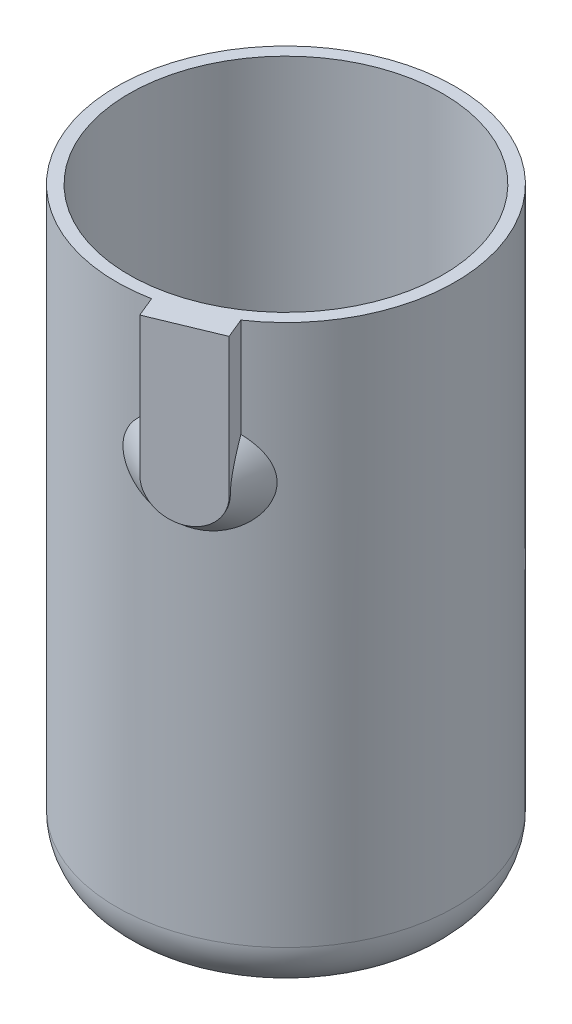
ISO-10303-21;
HEADER;
FILE_DESCRIPTION(('STEP AP214'),'2;1');
FILE_NAME('part.step','',(''),(''),'','','');
FILE_SCHEMA(('AUTOMOTIVE_DESIGN { 1 0 10303 214 1 1 1 1 }'));
ENDSEC;
DATA;
#1=APPLICATION_CONTEXT('core data for automotive mechanical design processes');
#2=APPLICATION_PROTOCOL_DEFINITION('international standard','automotive_design',2000,#1);
#3=PRODUCT_CONTEXT('',#1,'mechanical');
#4=PRODUCT('Part','Part','',(#3));
#5=PRODUCT_RELATED_PRODUCT_CATEGORY('part','',(#4));
#6=PRODUCT_DEFINITION_FORMATION('','',#4);
#7=PRODUCT_DEFINITION_CONTEXT('part definition',#1,'design');
#8=PRODUCT_DEFINITION('design','',#6,#7);
#9=PRODUCT_DEFINITION_SHAPE('','',#8);
#10=(LENGTH_UNIT() NAMED_UNIT(*) SI_UNIT(.MILLI.,.METRE.));
#11=(NAMED_UNIT(*) PLANE_ANGLE_UNIT() SI_UNIT($,.RADIAN.));
#12=(NAMED_UNIT(*) SI_UNIT($,.STERADIAN.) SOLID_ANGLE_UNIT());
#13=UNCERTAINTY_MEASURE_WITH_UNIT(LENGTH_MEASURE(1.E-05),#10,'distance_accuracy_value','');
#14=(GEOMETRIC_REPRESENTATION_CONTEXT(3) GLOBAL_UNCERTAINTY_ASSIGNED_CONTEXT((#13)) GLOBAL_UNIT_ASSIGNED_CONTEXT((#10,
#11,#12)) REPRESENTATION_CONTEXT('',''));
#15=CARTESIAN_POINT('',(0.,0.,0.));
#16=DIRECTION('',(0.,0.,1.));
#17=DIRECTION('',(1.,0.,0.));
#18=AXIS2_PLACEMENT_3D('',#15,#16,#17);
#19=CARTESIAN_POINT('',(0.,0.,0.));
#20=DIRECTION('',(0.,-1.,0.));
#21=DIRECTION('',(0.,0.,-1.));
#22=AXIS2_PLACEMENT_3D('',#19,#20,#21);
#23=CYLINDRICAL_SURFACE('',#22,27.25);
#24=CARTESIAN_POINT('',(0.,-87.1,0.));
#25=DIRECTION('',(0.,-1.,0.));
#26=DIRECTION('',(0.,0.,-1.));
#27=AXIS2_PLACEMENT_3D('',#24,#25,#26);
#28=CIRCLE('',#27,27.25);
#29=CARTESIAN_POINT('',(0.,-87.1,-27.25));
#30=VERTEX_POINT('',#29);
#31=EDGE_CURVE('E207',#30,#30,#28,.T.);
#32=ORIENTED_EDGE('',*,*,#31,.F.);
#33=EDGE_LOOP('',(#32));
#34=FACE_BOUND('',#33,.T.);
#35=CARTESIAN_POINT('',(0.,0.,0.));
#36=DIRECTION('',(0.,-1.,0.));
#37=DIRECTION('',(0.,0.,-1.));
#38=AXIS2_PLACEMENT_3D('',#35,#36,#37);
#39=CIRCLE('',#38,27.25);
#40=CARTESIAN_POINT('',(5.13217080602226,0.,26.7623489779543));
#41=VERTEX_POINT('',#40);
#42=CARTESIAN_POINT('',(15.2948456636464,0.,22.5528312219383));
#43=VERTEX_POINT('',#42);
#44=EDGE_CURVE('E57',#41,#43,#39,.T.);
#45=ORIENTED_EDGE('',*,*,#44,.T.);
#46=DIRECTION('',(0.,-1.,0.));
#47=VECTOR('',#46,1.);
#48=CARTESIAN_POINT('',(15.2948456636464,0.,22.5528312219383));
#49=LINE('',#48,#47);
#50=CARTESIAN_POINT('',(15.2948456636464,-15.9293145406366,22.5528312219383));
#51=VERTEX_POINT('',#50);
#52=EDGE_CURVE('E145',#43,#51,#49,.T.);
#53=ORIENTED_EDGE('',*,*,#52,.T.);
#54=CARTESIAN_POINT('',(3.39021248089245,-27.3423893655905,27.0382869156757));
#55=CARTESIAN_POINT('',(3.58895261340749,-27.53196795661,27.0133671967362));
#56=CARTESIAN_POINT('',(3.79571275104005,-27.712737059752,26.9852110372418));
#57=CARTESIAN_POINT('',(4.22272311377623,-28.0563612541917,26.9216965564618));
#58=CARTESIAN_POINT('',(4.44298101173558,-28.2192060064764,26.8863341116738));
#59=CARTESIAN_POINT('',(4.89513629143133,-28.52687842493,26.807702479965));
#60=CARTESIAN_POINT('',(5.12705897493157,-28.6716643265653,26.7644155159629));
#61=CARTESIAN_POINT('',(5.60001691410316,-28.9423832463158,26.6694673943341));
#62=CARTESIAN_POINT('',(5.8410525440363,-29.0683154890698,26.6178058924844));
#63=CARTESIAN_POINT('',(6.33176683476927,-29.3015675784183,26.5053761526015));
#64=CARTESIAN_POINT('',(6.58148878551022,-29.4087708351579,26.4445549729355));
#65=CARTESIAN_POINT('',(7.08628998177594,-29.6031445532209,26.3137791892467));
#66=CARTESIAN_POINT('',(7.34136937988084,-29.6903144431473,26.2438243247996));
#67=CARTESIAN_POINT('',(7.85477618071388,-29.8440752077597,26.094757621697));
#68=CARTESIAN_POINT('',(8.11310058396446,-29.91068381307,26.0156537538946));
#69=CARTESIAN_POINT('',(8.63134056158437,-30.0230071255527,25.8483384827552));
#70=CARTESIAN_POINT('',(8.89125614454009,-30.0687217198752,25.7601270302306));
#71=CARTESIAN_POINT('',(9.41921029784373,-30.1400743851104,25.5718990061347));
#72=CARTESIAN_POINT('',(9.68724021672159,-30.1650166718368,25.4715932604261));
#73=CARTESIAN_POINT('',(10.2209959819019,-30.1921021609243,25.2621443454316));
#74=CARTESIAN_POINT('',(10.4867217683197,-30.1942447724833,25.1530009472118));
#75=CARTESIAN_POINT('',(11.0139427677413,-30.1757119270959,24.9266498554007));
#76=CARTESIAN_POINT('',(11.2754375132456,-30.1550339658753,24.8094412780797));
#77=CARTESIAN_POINT('',(11.7923185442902,-30.0910190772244,24.5679688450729));
#78=CARTESIAN_POINT('',(12.0477049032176,-30.0476824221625,24.4437050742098));
#79=CARTESIAN_POINT('',(12.5474217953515,-29.9393774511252,24.1909508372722));
#80=CARTESIAN_POINT('',(12.7918523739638,-29.8746950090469,24.0625354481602));
#81=CARTESIAN_POINT('',(13.2716072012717,-29.7239955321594,23.8012930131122));
#82=CARTESIAN_POINT('',(13.5069314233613,-29.6379784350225,23.6684659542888));
#83=CARTESIAN_POINT('',(13.9672875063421,-29.4450355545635,23.3997536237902));
#84=CARTESIAN_POINT('',(14.1923116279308,-29.3380943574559,23.2638661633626));
#85=CARTESIAN_POINT('',(14.6306370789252,-29.103863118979,22.9907295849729));
#86=CARTESIAN_POINT('',(14.8439384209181,-28.9765730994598,22.8534804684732));
#87=CARTESIAN_POINT('',(15.261009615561,-28.6999029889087,22.5771492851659));
#88=CARTESIAN_POINT('',(15.4645681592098,-28.550197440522,22.4380736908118));
#89=CARTESIAN_POINT('',(15.8571145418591,-28.230752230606,22.1623993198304));
#90=CARTESIAN_POINT('',(16.0461032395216,-28.0610137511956,22.025800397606));
#91=CARTESIAN_POINT('',(16.4080576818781,-27.7020268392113,21.7575005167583));
#92=CARTESIAN_POINT('',(16.5810364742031,-27.5127945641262,21.6257956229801));
#93=CARTESIAN_POINT('',(16.9095211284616,-27.1152156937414,21.3699315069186));
#94=CARTESIAN_POINT('',(17.0650339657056,-26.9068767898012,21.2457692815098));
#95=CARTESIAN_POINT('',(17.4182638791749,-26.3798438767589,20.9580018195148));
#96=CARTESIAN_POINT('',(17.6062811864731,-26.0515466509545,20.799727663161));
#97=CARTESIAN_POINT('',(17.9366989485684,-25.3601194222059,20.5154821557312));
#98=CARTESIAN_POINT('',(18.0791772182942,-24.9970502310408,20.3894557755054));
#99=CARTESIAN_POINT('',(18.292024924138,-24.3034344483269,20.1985503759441));
#100=CARTESIAN_POINT('',(18.3703468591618,-23.9771807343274,20.1270650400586));
#101=CARTESIAN_POINT('',(18.4851144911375,-23.3114724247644,20.0217203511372));
#102=CARTESIAN_POINT('',(18.5215915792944,-22.9720279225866,19.9878327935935));
#103=CARTESIAN_POINT('',(18.5501837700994,-22.2887178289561,19.9613032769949));
#104=CARTESIAN_POINT('',(18.5421825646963,-21.9448429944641,19.9687694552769));
#105=CARTESIAN_POINT('',(18.482148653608,-21.2643164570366,20.0243411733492));
#106=CARTESIAN_POINT('',(18.4300999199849,-20.9276674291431,20.0724615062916));
#107=CARTESIAN_POINT('',(18.2877559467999,-20.2811026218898,20.2022089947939));
#108=CARTESIAN_POINT('',(18.1987189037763,-19.9706785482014,20.2827313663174));
#109=CARTESIAN_POINT('',(17.9869501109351,-19.370256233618,20.4707636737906));
#110=CARTESIAN_POINT('',(17.8641959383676,-19.0802717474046,20.5782915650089));
#111=CARTESIAN_POINT('',(17.526813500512,-18.3974832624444,20.8672500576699));
#112=CARTESIAN_POINT('',(17.2957550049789,-18.0175968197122,21.060094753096));
#113=CARTESIAN_POINT('',(16.7816419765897,-17.3108982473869,21.4720227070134));
#114=CARTESIAN_POINT('',(16.4985033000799,-16.9841736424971,21.6911482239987));
#115=CARTESIAN_POINT('',(15.8832490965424,-16.3814404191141,22.145732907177));
#116=CARTESIAN_POINT('',(15.5504528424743,-16.1062807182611,22.3813901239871));
#117=CARTESIAN_POINT('',(14.8453985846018,-15.6150877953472,22.8551240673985));
#118=CARTESIAN_POINT('',(14.4731513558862,-15.3990384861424,23.0932001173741));
#119=CARTESIAN_POINT('',(13.8595644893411,-15.1067611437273,23.4636819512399));
#120=CARTESIAN_POINT('',(13.6291340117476,-15.009971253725,23.598355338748));
#121=CARTESIAN_POINT('',(13.1583744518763,-14.8375024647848,23.8640444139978));
#122=CARTESIAN_POINT('',(12.9180444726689,-14.7618254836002,23.9950597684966));
#123=CARTESIAN_POINT('',(12.4289190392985,-14.6320780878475,24.2520276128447));
#124=CARTESIAN_POINT('',(12.1801213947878,-14.5780133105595,24.3779787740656));
#125=CARTESIAN_POINT('',(11.6756895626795,-14.4918897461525,24.6235547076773));
#126=CARTESIAN_POINT('',(11.4200555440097,-14.4598304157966,24.7431796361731));
#127=CARTESIAN_POINT('',(10.901455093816,-14.4177803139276,24.9760336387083));
#128=CARTESIAN_POINT('',(10.6384446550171,-14.4079805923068,25.0891992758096));
#129=CARTESIAN_POINT('',(10.1090934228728,-14.411088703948,25.3071266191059));
#130=CARTESIAN_POINT('',(9.84275258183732,-14.4239968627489,25.4118882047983));
#131=CARTESIAN_POINT('',(9.30875605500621,-14.4724153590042,25.612318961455));
#132=CARTESIAN_POINT('',(9.0411005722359,-14.5079223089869,25.7079894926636));
#133=CARTESIAN_POINT('',(8.50645619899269,-14.6012654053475,25.8898132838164));
#134=CARTESIAN_POINT('',(8.23946730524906,-14.6591014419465,25.9759665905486));
#135=CARTESIAN_POINT('',(7.7105597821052,-14.7960844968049,26.1378189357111));
#136=CARTESIAN_POINT('',(7.44861717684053,-14.8750373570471,26.2136041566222));
#137=CARTESIAN_POINT('',(6.92937561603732,-15.0539977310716,26.3556199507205));
#138=CARTESIAN_POINT('',(6.67207669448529,-15.1540053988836,26.4218504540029));
#139=CARTESIAN_POINT('',(6.16387451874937,-15.3746673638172,26.5450104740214));
#140=CARTESIAN_POINT('',(5.91297786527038,-15.4953420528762,26.6019306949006));
#141=CARTESIAN_POINT('',(5.4199045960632,-15.7567595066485,26.7067531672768));
#142=CARTESIAN_POINT('',(5.17772793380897,-15.8975021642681,26.7546554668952));
#143=CARTESIAN_POINT('',(4.70044423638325,-16.2010225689,26.8426553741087));
#144=CARTESIAN_POINT('',(4.46551376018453,-16.3641185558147,26.8826149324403));
#145=CARTESIAN_POINT('',(4.00940706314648,-16.7101168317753,26.9544143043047));
#146=CARTESIAN_POINT('',(3.78822952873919,-16.8930172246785,26.9862548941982));
#147=CARTESIAN_POINT('',(3.36272548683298,-17.2780043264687,27.0425692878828));
#148=CARTESIAN_POINT('',(3.15837608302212,-17.4800641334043,27.0670532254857));
#149=CARTESIAN_POINT('',(2.76964169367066,-17.9030098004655,27.1095893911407));
#150=CARTESIAN_POINT('',(2.5852468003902,-18.1238862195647,27.127644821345));
#151=CARTESIAN_POINT('',(2.18012149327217,-18.6640131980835,27.1636511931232));
#152=CARTESIAN_POINT('',(1.96903151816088,-18.9907764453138,27.1793854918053));
#153=CARTESIAN_POINT('',(1.60164588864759,-19.6742305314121,27.2035186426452));
#154=CARTESIAN_POINT('',(1.44528696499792,-20.0308862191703,27.2119259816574));
#155=CARTESIAN_POINT('',(1.2603492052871,-20.5843484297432,27.2209076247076));
#156=CARTESIAN_POINT('',(1.20681656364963,-20.7729947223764,27.2232995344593));
#157=CARTESIAN_POINT('',(1.11814216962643,-21.1545338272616,27.2270867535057));
#158=CARTESIAN_POINT('',(1.08299080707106,-21.3474243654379,27.2284825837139));
#159=CARTESIAN_POINT('',(1.03209314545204,-21.7356595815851,27.2304599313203));
#160=CARTESIAN_POINT('',(1.01633588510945,-21.9310028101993,27.2310419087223));
#161=CARTESIAN_POINT('',(1.0046292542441,-22.3222166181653,27.2314745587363));
#162=CARTESIAN_POINT('',(1.00867729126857,-22.5180871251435,27.2313253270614));
#163=CARTESIAN_POINT('',(1.04649052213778,-23.0475326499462,27.2299145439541));
#164=CARTESIAN_POINT('',(1.09935321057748,-23.379910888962,27.2279370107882));
#165=CARTESIAN_POINT('',(1.25871813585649,-24.0313363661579,27.2210253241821));
#166=CARTESIAN_POINT('',(1.36525478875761,-24.3503749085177,27.2160892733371));
#167=CARTESIAN_POINT('',(1.62806975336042,-24.9773821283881,27.2016469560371));
#168=CARTESIAN_POINT('',(1.78565093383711,-25.2847949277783,27.192017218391));
#169=CARTESIAN_POINT('',(2.14083923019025,-25.8748248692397,27.1663554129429));
#170=CARTESIAN_POINT('',(2.33842736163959,-26.1574536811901,27.1503263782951));
#171=CARTESIAN_POINT('',(2.68098585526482,-26.5891390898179,27.1181052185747));
#172=CARTESIAN_POINT('',(2.81571589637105,-26.746689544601,27.1045026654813));
#173=CARTESIAN_POINT('',(3.09552046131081,-27.0519533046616,27.0739735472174));
#174=CARTESIAN_POINT('',(3.24059375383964,-27.1996677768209,27.0570473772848));
#175=CARTESIAN_POINT('',(3.39021248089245,-27.3423893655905,27.0382869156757));
#176=B_SPLINE_CURVE_WITH_KNOTS('',3,(#54,#55,#56,#57,#58,#59,#60,#61,#62,#63,#64,#65,#66,#67,
#68,#69,#70,#71,#72,#73,#74,#75,#76,#77,#78,#79,#80,#81,#82,#83,#84,#85,#86,#87,#88,#89,#90,#91,
#92,#93,#94,#95,#96,#97,#98,#99,#100,#101,#102,#103,#104,#105,#106,#107,#108,#109,#110,#111,
#112,#113,#114,#115,#116,#117,#118,#119,#120,#121,#122,#123,#124,#125,#126,#127,#128,#129,#130,
#131,#132,#133,#134,#135,#136,#137,#138,#139,#140,#141,#142,#143,#144,#145,#146,#147,#148,#149,
#150,#151,#152,#153,#154,#155,#156,#157,#158,#159,#160,#161,#162,#163,#164,#165,#166,#167,#168,
#169,#170,#171,#172,#173,#174,#175),.UNSPECIFIED.,.T.,.F.,(4,2,2,2,2,2,2,2,2,2,2,2,2,2,2,2,2,2,
2,2,2,2,2,2,2,2,2,2,2,2,2,2,2,2,2,2,2,2,2,2,2,2,2,2,2,2,2,2,2,2,2,2,2,2,2,2,2,2,2,2,4),(0.,
0.827146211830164,1.65476706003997,2.48426778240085,3.31380260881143,4.14833038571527,
4.98288196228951,5.81671185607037,6.65054625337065,7.51129970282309,8.37207545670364,
9.23294567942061,10.0938055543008,10.9435749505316,11.7933468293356,12.6437470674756,
13.494146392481,14.358369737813,15.2225421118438,16.0860038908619,16.9491195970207,
18.1746763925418,19.3981276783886,20.4229041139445,21.4469112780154,22.4735974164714,
23.5006573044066,24.4953206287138,25.4906470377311,26.9367776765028,28.3852656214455,
29.8558314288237,31.3259966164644,32.1768697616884,33.0278201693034,33.8789923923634,
34.7301436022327,35.5885729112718,36.4470145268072,37.3053274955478,38.1636362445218,
39.0143095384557,39.8649890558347,40.7165128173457,41.5680320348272,42.4332586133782,
43.298402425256,44.1623489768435,45.0258645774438,46.1894536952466,47.3516932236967,
47.9392502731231,48.5264998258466,49.1134173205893,49.7002579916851,50.7047089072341,
51.7098047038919,52.7428969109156,53.775500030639,54.398279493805,55.0209849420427),.UNSPECIFIED.);
#177=CARTESIAN_POINT('',(5.13217080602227,-15.9293145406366,26.7623489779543));
#178=VERTEX_POINT('',#177);
#179=EDGE_CURVE('E11',#178,#51,#176,.T.);
#180=ORIENTED_EDGE('',*,*,#179,.F.);
#181=DIRECTION('',(0.,-1.,0.));
#182=VECTOR('',#181,1.);
#183=CARTESIAN_POINT('',(5.13217080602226,0.,26.7623489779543));
#184=LINE('',#183,#182);
#185=EDGE_CURVE('E53',#178,#41,#184,.F.);
#186=ORIENTED_EDGE('',*,*,#185,.T.);
#187=EDGE_LOOP('',(#45,#53,#180,#186));
#188=FACE_BOUND('',#187,.T.);
#189=ADVANCED_FACE('F37',(#34,#188),#23,.T.);
#190=CARTESIAN_POINT('',(0.,0.,0.));
#191=DIRECTION('',(0.,-1.,0.));
#192=DIRECTION('',(0.,0.,-1.));
#193=AXIS2_PLACEMENT_3D('',#190,#191,#192);
#194=CYLINDRICAL_SURFACE('',#193,25.25);
#195=CARTESIAN_POINT('',(0.,0.,0.));
#196=DIRECTION('',(0.,-1.,0.));
#197=DIRECTION('',(0.,0.,-1.));
#198=AXIS2_PLACEMENT_3D('',#195,#196,#197);
#199=CIRCLE('',#198,25.25);
#200=CARTESIAN_POINT('',(0.,0.,-25.25));
#201=VERTEX_POINT('',#200);
#202=EDGE_CURVE('E211',#201,#201,#199,.T.);
#203=ORIENTED_EDGE('',*,*,#202,.F.);
#204=EDGE_LOOP('',(#203));
#205=FACE_BOUND('',#204,.T.);
#206=CARTESIAN_POINT('',(0.,-85.1,0.));
#207=DIRECTION('',(0.,-1.,0.));
#208=DIRECTION('',(0.,0.,-1.));
#209=AXIS2_PLACEMENT_3D('',#206,#207,#208);
#210=CIRCLE('',#209,25.25);
#211=CARTESIAN_POINT('',(0.,-85.1,-25.25));
#212=VERTEX_POINT('',#211);
#213=EDGE_CURVE('E214',#212,#212,#210,.T.);
#214=ORIENTED_EDGE('',*,*,#213,.T.);
#215=EDGE_LOOP('',(#214));
#216=FACE_BOUND('',#215,.T.);
#217=ADVANCED_FACE('F159',(#205,#216),#194,.F.);
#218=CARTESIAN_POINT('',(0.,-93.3,0.));
#219=DIRECTION('',(0.,1.,0.));
#220=DIRECTION('',(0.,0.,1.));
#221=AXIS2_PLACEMENT_3D('',#218,#219,#220);
#222=PLANE('',#221);
#223=CARTESIAN_POINT('',(0.,-93.3,0.));
#224=DIRECTION('',(0.,-1.,0.));
#225=DIRECTION('',(0.,0.,-1.));
#226=AXIS2_PLACEMENT_3D('',#223,#224,#225);
#227=CIRCLE('',#226,9.);
#228=CARTESIAN_POINT('',(0.,-93.3,-9.));
#229=VERTEX_POINT('',#228);
#230=EDGE_CURVE('E41',#229,#229,#227,.T.);
#231=ORIENTED_EDGE('',*,*,#230,.T.);
#232=EDGE_LOOP('',(#231));
#233=FACE_BOUND('',#232,.T.);
#234=ADVANCED_FACE('F39',(#233),#222,.F.);
#235=CARTESIAN_POINT('',(0.,-92.3,0.));
#236=DIRECTION('',(0.,-1.,0.));
#237=DIRECTION('',(0.,0.,-1.));
#238=AXIS2_PLACEMENT_3D('',#235,#236,#237);
#239=TOROIDAL_SURFACE('',#238,9.00000000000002,0.999999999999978);
#240=ORIENTED_EDGE('',*,*,#230,.F.);
#241=EDGE_LOOP('',(#240));
#242=FACE_BOUND('',#241,.T.);
#243=CARTESIAN_POINT('',(0.,-92.3,0.));
#244=DIRECTION('',(0.,-1.,0.));
#245=DIRECTION('',(0.,0.,-1.));
#246=AXIS2_PLACEMENT_3D('',#243,#244,#245);
#247=CIRCLE('',#246,9.99999999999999);
#248=CARTESIAN_POINT('',(0.,-92.3,-9.99999999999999));
#249=VERTEX_POINT('',#248);
#250=EDGE_CURVE('E193',#249,#249,#247,.T.);
#251=ORIENTED_EDGE('',*,*,#250,.T.);
#252=EDGE_LOOP('',(#251));
#253=FACE_BOUND('',#252,.T.);
#254=ADVANCED_FACE('F180',(#242,#253),#239,.T.);
#255=CARTESIAN_POINT('',(0.,0.,0.));
#256=DIRECTION('',(0.,-1.,0.));
#257=DIRECTION('',(0.,0.,-1.));
#258=AXIS2_PLACEMENT_3D('',#255,#256,#257);
#259=CYLINDRICAL_SURFACE('',#258,10.);
#260=ORIENTED_EDGE('',*,*,#250,.F.);
#261=EDGE_LOOP('',(#260));
#262=FACE_BOUND('',#261,.T.);
#263=CARTESIAN_POINT('',(0.,-90.3,0.));
#264=DIRECTION('',(0.,-1.,0.));
#265=DIRECTION('',(0.,0.,-1.));
#266=AXIS2_PLACEMENT_3D('',#263,#264,#265);
#267=CIRCLE('',#266,10.);
#268=CARTESIAN_POINT('',(0.,-90.3,-10.));
#269=VERTEX_POINT('',#268);
#270=EDGE_CURVE('E194',#269,#269,#267,.T.);
#271=ORIENTED_EDGE('',*,*,#270,.T.);
#272=EDGE_LOOP('',(#271));
#273=FACE_BOUND('',#272,.T.);
#274=ADVANCED_FACE('F177',(#262,#273),#259,.T.);
#275=CARTESIAN_POINT('',(0.,-80.2999999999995,0.));
#276=DIRECTION('',(0.,-1.,0.));
#277=DIRECTION('',(0.,0.,-1.));
#278=AXIS2_PLACEMENT_3D('',#275,#276,#277);
#279=DEGENERATE_TOROIDAL_SURFACE('',#278,9.99999999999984,10.0000000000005,.T.);
#280=ORIENTED_EDGE('',*,*,#270,.F.);
#281=EDGE_LOOP('',(#280));
#282=FACE_BOUND('',#281,.T.);
#283=CARTESIAN_POINT('',(0.,-88.9602540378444,0.));
#284=DIRECTION('',(0.,-1.,0.));
#285=DIRECTION('',(0.,0.,-1.));
#286=AXIS2_PLACEMENT_3D('',#283,#284,#285);
#287=CIRCLE('',#286,15.);
#288=CARTESIAN_POINT('',(0.,-88.9602540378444,-15.));
#289=VERTEX_POINT('',#288);
#290=EDGE_CURVE('E196',#289,#289,#287,.T.);
#291=ORIENTED_EDGE('',*,*,#290,.T.);
#292=EDGE_LOOP('',(#291));
#293=FACE_BOUND('',#292,.T.);
#294=ADVANCED_FACE('F173',(#282,#293),#279,.T.);
#295=CARTESIAN_POINT('',(0.,0.,0.));
#296=DIRECTION('',(0.,-1.,0.));
#297=DIRECTION('',(0.,0.,-1.));
#298=AXIS2_PLACEMENT_3D('',#295,#296,#297);
#299=CYLINDRICAL_SURFACE('',#298,15.);
#300=ORIENTED_EDGE('',*,*,#290,.F.);
#301=EDGE_LOOP('',(#300));
#302=FACE_BOUND('',#301,.T.);
#303=CARTESIAN_POINT('',(0.,-95.3,0.));
#304=DIRECTION('',(0.,-1.,0.));
#305=DIRECTION('',(0.,0.,-1.));
#306=AXIS2_PLACEMENT_3D('',#303,#304,#305);
#307=CIRCLE('',#306,15.);
#308=CARTESIAN_POINT('',(0.,-95.3,-15.));
#309=VERTEX_POINT('',#308);
#310=EDGE_CURVE('E201',#309,#309,#307,.T.);
#311=ORIENTED_EDGE('',*,*,#310,.T.);
#312=EDGE_LOOP('',(#311));
#313=FACE_BOUND('',#312,.T.);
#314=ADVANCED_FACE('F169',(#302,#313),#299,.F.);
#315=CARTESIAN_POINT('',(-15.,-95.3,0.));
#316=DIRECTION('',(0.,1.,0.));
#317=DIRECTION('',(0.,0.,1.));
#318=AXIS2_PLACEMENT_3D('',#315,#316,#317);
#319=PLANE('',#318);
#320=ORIENTED_EDGE('',*,*,#310,.F.);
#321=EDGE_LOOP('',(#320));
#322=FACE_BOUND('',#321,.T.);
#323=CARTESIAN_POINT('',(0.,-95.3,0.));
#324=DIRECTION('',(0.,-1.,0.));
#325=DIRECTION('',(0.,0.,-1.));
#326=AXIS2_PLACEMENT_3D('',#323,#324,#325);
#327=CIRCLE('',#326,19.05);
#328=CARTESIAN_POINT('',(0.,-95.3,-19.05));
#329=VERTEX_POINT('',#328);
#330=EDGE_CURVE('E204',#329,#329,#327,.T.);
#331=ORIENTED_EDGE('',*,*,#330,.T.);
#332=EDGE_LOOP('',(#331));
#333=FACE_BOUND('',#332,.T.);
#334=ADVANCED_FACE('F165',(#322,#333),#319,.F.);
#335=CARTESIAN_POINT('',(0.,-87.1,0.));
#336=DIRECTION('',(0.,-1.,0.));
#337=DIRECTION('',(0.,0.,-1.));
#338=AXIS2_PLACEMENT_3D('',#335,#336,#337);
#339=TOROIDAL_SURFACE('',#338,19.05,8.20000000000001);
#340=ORIENTED_EDGE('',*,*,#330,.F.);
#341=EDGE_LOOP('',(#340));
#342=FACE_BOUND('',#341,.T.);
#343=ORIENTED_EDGE('',*,*,#31,.T.);
#344=EDGE_LOOP('',(#343));
#345=FACE_BOUND('',#344,.T.);
#346=ADVANCED_FACE('F162',(#342,#345),#339,.T.);
#347=CARTESIAN_POINT('',(-27.25,0.,0.));
#348=DIRECTION('',(0.,-1.,0.));
#349=DIRECTION('',(0.,0.,-1.));
#350=AXIS2_PLACEMENT_3D('',#347,#348,#349);
#351=PLANE('',#350);
#352=ORIENTED_EDGE('',*,*,#44,.F.);
#353=DIRECTION('',(0.38268343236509,0.,0.923879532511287));
#354=VECTOR('',#353,1.);
#355=CARTESIAN_POINT('',(4.93348799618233,0.,26.2826862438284));
#356=LINE('',#355,#354);
#357=CARTESIAN_POINT('',(6.46422172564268,0.,29.9782043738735));
#358=VERTEX_POINT('',#357);
#359=EDGE_CURVE('E84',#41,#358,#356,.T.);
#360=ORIENTED_EDGE('',*,*,#359,.T.);
#361=DIRECTION('',(-0.923879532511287,0.,0.38268343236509));
#362=VECTOR('',#361,1.);
#363=CARTESIAN_POINT('',(16.6268965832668,0.,25.7686866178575));
#364=LINE('',#363,#362);
#365=CARTESIAN_POINT('',(16.6268965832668,0.,25.7686866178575));
#366=VERTEX_POINT('',#365);
#367=EDGE_CURVE('E90',#366,#358,#364,.T.);
#368=ORIENTED_EDGE('',*,*,#367,.F.);
#369=DIRECTION('',(0.38268343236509,0.,0.923879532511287));
#370=VECTOR('',#369,1.);
#371=CARTESIAN_POINT('',(15.0961628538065,0.,22.0731684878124));
#372=LINE('',#371,#370);
#373=EDGE_CURVE('E112',#43,#366,#372,.T.);
#374=ORIENTED_EDGE('',*,*,#373,.F.);
#375=EDGE_LOOP('',(#352,#360,#368,#374));
#376=FACE_BOUND('',#375,.T.);
#377=ORIENTED_EDGE('',*,*,#202,.T.);
#378=EDGE_LOOP('',(#377));
#379=FACE_BOUND('',#378,.T.);
#380=ADVANCED_FACE('F86',(#376,#379),#351,.F.);
#381=CARTESIAN_POINT('',(0.,-85.1,0.));
#382=DIRECTION('',(0.,-1.,0.));
#383=DIRECTION('',(0.,0.,-1.));
#384=AXIS2_PLACEMENT_3D('',#381,#382,#383);
#385=TOROIDAL_SURFACE('',#384,17.05,8.20000000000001);
#386=ORIENTED_EDGE('',*,*,#213,.F.);
#387=EDGE_LOOP('',(#386));
#388=FACE_BOUND('',#387,.T.);
#389=CARTESIAN_POINT('',(0.,-93.3,0.));
#390=DIRECTION('',(0.,-1.,0.));
#391=DIRECTION('',(0.,0.,-1.));
#392=AXIS2_PLACEMENT_3D('',#389,#390,#391);
#393=CIRCLE('',#392,17.05);
#394=CARTESIAN_POINT('',(0.,-93.3,-17.05));
#395=VERTEX_POINT('',#394);
#396=EDGE_CURVE('E217',#395,#395,#393,.T.);
#397=ORIENTED_EDGE('',*,*,#396,.T.);
#398=EDGE_LOOP('',(#397));
#399=FACE_BOUND('',#398,.T.);
#400=ADVANCED_FACE('F241',(#388,#399),#385,.F.);
#401=CARTESIAN_POINT('',(-17.05,-93.3,0.));
#402=DIRECTION('',(0.,-1.,0.));
#403=DIRECTION('',(0.,0.,-1.));
#404=AXIS2_PLACEMENT_3D('',#401,#402,#403);
#405=PLANE('',#404);
#406=ORIENTED_EDGE('',*,*,#396,.F.);
#407=EDGE_LOOP('',(#406));
#408=FACE_BOUND('',#407,.T.);
#409=CARTESIAN_POINT('',(0.,-93.3,0.));
#410=DIRECTION('',(0.,-1.,0.));
#411=DIRECTION('',(0.,0.,-1.));
#412=AXIS2_PLACEMENT_3D('',#409,#410,#411);
#413=CIRCLE('',#412,17.);
#414=CARTESIAN_POINT('',(0.,-93.3,-17.));
#415=VERTEX_POINT('',#414);
#416=EDGE_CURVE('E219',#415,#415,#413,.T.);
#417=ORIENTED_EDGE('',*,*,#416,.T.);
#418=EDGE_LOOP('',(#417));
#419=FACE_BOUND('',#418,.T.);
#420=ADVANCED_FACE('F235',(#408,#419),#405,.F.);
#421=CARTESIAN_POINT('',(0.,0.,0.));
#422=DIRECTION('',(0.,-1.,0.));
#423=DIRECTION('',(0.,0.,-1.));
#424=AXIS2_PLACEMENT_3D('',#421,#422,#423);
#425=CYLINDRICAL_SURFACE('',#424,17.);
#426=ORIENTED_EDGE('',*,*,#416,.F.);
#427=EDGE_LOOP('',(#426));
#428=FACE_BOUND('',#427,.T.);
#429=CARTESIAN_POINT('',(0.,-86.9602540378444,0.));
#430=DIRECTION('',(0.,-1.,0.));
#431=DIRECTION('',(0.,0.,-1.));
#432=AXIS2_PLACEMENT_3D('',#429,#430,#431);
#433=CIRCLE('',#432,17.);
#434=CARTESIAN_POINT('',(0.,-86.9602540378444,-17.));
#435=VERTEX_POINT('',#434);
#436=EDGE_CURVE('E149',#435,#435,#433,.T.);
#437=ORIENTED_EDGE('',*,*,#436,.T.);
#438=EDGE_LOOP('',(#437));
#439=FACE_BOUND('',#438,.T.);
#440=ADVANCED_FACE('F226',(#428,#439),#425,.T.);
#441=CARTESIAN_POINT('',(-17.,-86.9602540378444,0.));
#442=DIRECTION('',(0.,-1.,0.));
#443=DIRECTION('',(0.,0.,-1.));
#444=AXIS2_PLACEMENT_3D('',#441,#442,#443);
#445=PLANE('',#444);
#446=ORIENTED_EDGE('',*,*,#436,.F.);
#447=EDGE_LOOP('',(#446));
#448=FACE_BOUND('',#447,.T.);
#449=ADVANCED_FACE('F228',(#448),#445,.F.);
#450=CARTESIAN_POINT('',(9.56708580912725,-22.3,23.0969883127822));
#451=DIRECTION('',(-0.38268343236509,0.,-0.923879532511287));
#452=DIRECTION('',(-0.923879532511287,0.,0.38268343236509));
#453=AXIS2_PLACEMENT_3D('',#450,#451,#452);
#454=CONICAL_SURFACE('',#453,10.,0.753151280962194);
#455=ORIENTED_EDGE('',*,*,#179,.T.);
#456=CARTESIAN_POINT('',(15.096080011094,-15.2986252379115,22.0729684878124));
#457=CARTESIAN_POINT('',(15.1455588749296,-15.4527940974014,22.1924210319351));
#458=CARTESIAN_POINT('',(15.1946832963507,-15.6077496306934,22.3110178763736));
#459=CARTESIAN_POINT('',(15.292070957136,-15.9195396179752,22.5461324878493));
#460=CARTESIAN_POINT('',(15.3403340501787,-16.0763743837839,22.6626499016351));
#461=CARTESIAN_POINT('',(15.4360798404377,-16.393002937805,22.8938006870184));
#462=CARTESIAN_POINT('',(15.4835571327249,-16.5528079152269,23.008421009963));
#463=CARTESIAN_POINT('',(15.5772498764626,-16.8749164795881,23.2346153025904));
#464=CARTESIAN_POINT('',(15.6234653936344,-17.0372199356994,23.3461894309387));
#465=CARTESIAN_POINT('',(15.7166412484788,-17.3729633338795,23.5711358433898));
#466=CARTESIAN_POINT('',(15.7635226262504,-17.5465534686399,23.6843175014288));
#467=CARTESIAN_POINT('',(15.8551790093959,-17.8975379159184,23.9055955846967));
#468=CARTESIAN_POINT('',(15.8999537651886,-18.0749326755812,24.0136914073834));
#469=CARTESIAN_POINT('',(15.9867454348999,-18.4337771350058,24.2232250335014));
#470=CARTESIAN_POINT('',(16.0287679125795,-18.6152175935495,24.3246762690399));
#471=CARTESIAN_POINT('',(16.1094145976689,-18.9831539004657,24.5193745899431));
#472=CARTESIAN_POINT('',(16.1480398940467,-19.1696481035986,24.6126243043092));
#473=CARTESIAN_POINT('',(16.2165749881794,-19.5257147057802,24.7780826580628));
#474=CARTESIAN_POINT('',(16.2469745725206,-19.694638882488,24.8514737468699));
#475=CARTESIAN_POINT('',(16.3035838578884,-20.0373261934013,24.988140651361));
#476=CARTESIAN_POINT('',(16.3297923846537,-20.2110906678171,25.0514136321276));
#477=CARTESIAN_POINT('',(16.37672567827,-20.5611346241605,25.1647206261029));
#478=CARTESIAN_POINT('',(16.3975171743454,-20.7373522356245,25.2149157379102));
#479=CARTESIAN_POINT('',(16.4330322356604,-21.0938473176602,25.3006566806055));
#480=CARTESIAN_POINT('',(16.4477606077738,-21.2741214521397,25.3362141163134));
#481=CARTESIAN_POINT('',(16.4676255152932,-21.5949047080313,25.384172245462));
#482=CARTESIAN_POINT('',(16.4742028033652,-21.7348022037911,25.4000512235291));
#483=CARTESIAN_POINT('',(16.4808378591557,-21.945826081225,25.4160696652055));
#484=CARTESIAN_POINT('',(16.4825111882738,-22.0166214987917,25.4201094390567));
#485=CARTESIAN_POINT('',(16.4847455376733,-22.1583422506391,25.4255036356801));
#486=CARTESIAN_POINT('',(16.4853063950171,-22.2292676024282,25.4268576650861));
#487=CARTESIAN_POINT('',(16.4853037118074,-22.3002,25.4268511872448));
#488=B_SPLINE_CURVE_WITH_KNOTS('',3,(#456,#457,#458,#459,#460,#461,#462,#463,#464,#465,#466,
#467,#468,#469,#470,#471,#472,#473,#474,#475,#476,#477,#478,#479,#480,#481,#482,#483,#484,#485,
#486,#487),.UNSPECIFIED.,.F.,.F.,(4,2,2,2,2,2,2,2,2,2,2,2,2,2,2,4),(0.,0.603634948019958,
1.20737148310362,1.81426712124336,2.42113108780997,3.058441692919,3.69582761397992,
4.3318825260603,4.96773280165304,5.52743382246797,6.08729138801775,6.63988600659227,
7.19204167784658,7.61443137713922,7.82716858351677,8.03993694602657),.UNSPECIFIED.);
#489=CARTESIAN_POINT('',(16.4853037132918,-22.3,25.4268511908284));
#490=VERTEX_POINT('',#489);
#491=EDGE_CURVE('E140',#51,#490,#488,.T.);
#492=ORIENTED_EDGE('',*,*,#491,.T.);
#493=CARTESIAN_POINT('',(11.4039662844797,-22.3,27.5316100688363));
#494=DIRECTION('',(0.38268343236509,0.,0.923879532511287));
#495=DIRECTION('',(0.923879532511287,0.,-0.38268343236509));
#496=AXIS2_PLACEMENT_3D('',#493,#494,#495);
#497=CIRCLE('',#496,5.50000000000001);
#498=CARTESIAN_POINT('',(6.3226288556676,-22.3,29.6363689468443));
#499=VERTEX_POINT('',#498);
#500=EDGE_CURVE('E147',#499,#490,#497,.T.);
#501=ORIENTED_EDGE('',*,*,#500,.F.);
#502=CARTESIAN_POINT('',(6.32262885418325,-22.3002,29.6363689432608));
#503=CARTESIAN_POINT('',(6.32263124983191,-22.2304818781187,29.6363747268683));
#504=CARTESIAN_POINT('',(6.32208959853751,-22.160771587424,29.6350670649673));
#505=CARTESIAN_POINT('',(6.31993115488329,-22.0214712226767,29.6298561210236));
#506=CARTESIAN_POINT('',(6.3183144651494,-21.9518811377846,29.6259530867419));
#507=CARTESIAN_POINT('',(6.31187748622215,-21.7436344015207,29.610412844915));
#508=CARTESIAN_POINT('',(6.30547021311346,-21.6052936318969,29.5949443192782));
#509=CARTESIAN_POINT('',(6.28880691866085,-21.3324076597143,29.5547155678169));
#510=CARTESIAN_POINT('',(6.27861124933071,-21.197836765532,29.5301010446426));
#511=CARTESIAN_POINT('',(6.25471900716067,-20.930807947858,29.4724200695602));
#512=CARTESIAN_POINT('',(6.24102116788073,-20.7983508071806,29.4393505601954));
#513=CARTESIAN_POINT('',(6.19837768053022,-20.4312937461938,29.3364000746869));
#514=CARTESIAN_POINT('',(6.1659802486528,-20.199419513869,29.2581857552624));
#515=CARTESIAN_POINT('',(6.09351943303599,-19.743994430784,29.0832498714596));
#516=CARTESIAN_POINT('',(6.05344900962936,-19.5204514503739,28.9865113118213));
#517=CARTESIAN_POINT('',(5.9669668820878,-19.0779257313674,28.7777249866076));
#518=CARTESIAN_POINT('',(5.92047211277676,-18.8590551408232,28.6654766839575));
#519=CARTESIAN_POINT('',(5.82311141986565,-18.4282342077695,28.4304271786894));
#520=CARTESIAN_POINT('',(5.77224694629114,-18.2162816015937,28.3076294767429));
#521=CARTESIAN_POINT('',(5.65934273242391,-17.7667379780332,28.0350545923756));
#522=CARTESIAN_POINT('',(5.59677065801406,-17.5300655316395,27.8839922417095));
#523=CARTESIAN_POINT('',(5.46839768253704,-17.0627362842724,27.5740724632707));
#524=CARTESIAN_POINT('',(5.40259596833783,-16.8320810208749,27.4152130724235));
#525=CARTESIAN_POINT('',(5.27048560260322,-16.3821923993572,27.096270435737));
#526=CARTESIAN_POINT('',(5.20424546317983,-16.1628211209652,26.9363525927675));
#527=CARTESIAN_POINT('',(5.10357670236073,-15.836664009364,26.6933167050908));
#528=CARTESIAN_POINT('',(5.06981441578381,-15.7284656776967,26.61180733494));
#529=CARTESIAN_POINT('',(5.00189469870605,-15.5129257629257,26.4478346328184));
#530=CARTESIAN_POINT('',(4.9677372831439,-15.4055841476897,26.3653713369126));
#531=CARTESIAN_POINT('',(4.93340515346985,-15.2986252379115,26.2824862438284));
#532=B_SPLINE_CURVE_WITH_KNOTS('',3,(#502,#503,#504,#505,#506,#507,#508,#509,#510,#511,#512,
#513,#514,#515,#516,#517,#518,#519,#520,#521,#522,#523,#524,#525,#526,#527,#528,#529,#530,#531),
.UNSPECIFIED.,.F.,.F.,(4,2,2,2,2,2,2,2,2,2,2,2,2,2,4),(0.,0.209124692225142,0.418229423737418,
0.835817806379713,1.24702056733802,1.65837223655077,2.39755426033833,3.13741773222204,
3.88794375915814,4.63822168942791,5.50095027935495,6.36389720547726,7.20212537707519,
7.62094606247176,8.03975096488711),.UNSPECIFIED.);
#533=EDGE_CURVE('E114',#499,#178,#532,.T.);
#534=ORIENTED_EDGE('',*,*,#533,.T.);
#535=EDGE_LOOP('',(#455,#492,#501,#534));
#536=FACE_BOUND('',#535,.T.);
#537=ADVANCED_FACE('F125',(#536),#454,.T.);
#538=CARTESIAN_POINT('',(15.0961628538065,-22.3,22.0731684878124));
#539=DIRECTION('',(0.923879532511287,0.,-0.38268343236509));
#540=DIRECTION('',(-0.38268343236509,0.,-0.923879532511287));
#541=AXIS2_PLACEMENT_3D('',#538,#539,#540);
#542=PLANE('',#541);
#543=ORIENTED_EDGE('',*,*,#52,.F.);
#544=ORIENTED_EDGE('',*,*,#373,.T.);
#545=DIRECTION('',(0.,1.,0.));
#546=VECTOR('',#545,1.);
#547=CARTESIAN_POINT('',(16.6268965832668,-22.3,25.7686866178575));
#548=LINE('',#547,#546);
#549=CARTESIAN_POINT('',(16.6268965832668,-22.3,25.7686866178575));
#550=VERTEX_POINT('',#549);
#551=EDGE_CURVE('E94',#550,#366,#548,.T.);
#552=ORIENTED_EDGE('',*,*,#551,.F.);
#553=DIRECTION('',(0.38268343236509,0.,0.923879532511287));
#554=VECTOR('',#553,1.);
#555=CARTESIAN_POINT('',(15.0961628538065,-22.3,22.0731684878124));
#556=LINE('',#555,#554);
#557=EDGE_CURVE('E115',#490,#550,#556,.T.);
#558=ORIENTED_EDGE('',*,*,#557,.F.);
#559=ORIENTED_EDGE('',*,*,#491,.F.);
#560=EDGE_LOOP('',(#543,#544,#552,#558,#559));
#561=FACE_BOUND('',#560,.T.);
#562=ADVANCED_FACE('F134',(#561),#542,.T.);
#563=CARTESIAN_POINT('',(10.0148254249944,-22.3,24.1779273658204));
#564=DIRECTION('',(0.38268343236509,0.,0.923879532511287));
#565=DIRECTION('',(0.923879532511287,0.,-0.38268343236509));
#566=AXIS2_PLACEMENT_3D('',#563,#564,#565);
#567=CYLINDRICAL_SURFACE('',#566,5.5);
#568=ORIENTED_EDGE('',*,*,#500,.T.);
#569=ORIENTED_EDGE('',*,*,#557,.T.);
#570=CARTESIAN_POINT('',(11.5455591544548,-22.3,27.8734454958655));
#571=DIRECTION('',(0.38268343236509,0.,0.923879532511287));
#572=DIRECTION('',(0.923879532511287,0.,-0.38268343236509));
#573=AXIS2_PLACEMENT_3D('',#570,#571,#572);
#574=CIRCLE('',#573,5.5);
#575=CARTESIAN_POINT('',(6.46422172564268,-22.3,29.9782043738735));
#576=VERTEX_POINT('',#575);
#577=EDGE_CURVE('E104',#576,#550,#574,.T.);
#578=ORIENTED_EDGE('',*,*,#577,.F.);
#579=DIRECTION('',(0.38268343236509,0.,0.923879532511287));
#580=VECTOR('',#579,1.);
#581=CARTESIAN_POINT('',(4.93348799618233,-22.3,26.2826862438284));
#582=LINE('',#581,#580);
#583=EDGE_CURVE('E93',#499,#576,#582,.T.);
#584=ORIENTED_EDGE('',*,*,#583,.F.);
#585=EDGE_LOOP('',(#568,#569,#578,#584));
#586=FACE_BOUND('',#585,.T.);
#587=ADVANCED_FACE('F131',(#586),#567,.T.);
#588=CARTESIAN_POINT('',(4.93348799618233,0.,26.2826862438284));
#589=DIRECTION('',(-0.923879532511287,0.,0.38268343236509));
#590=DIRECTION('',(0.38268343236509,0.,0.923879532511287));
#591=AXIS2_PLACEMENT_3D('',#588,#589,#590);
#592=PLANE('',#591);
#593=ORIENTED_EDGE('',*,*,#185,.F.);
#594=ORIENTED_EDGE('',*,*,#533,.F.);
#595=ORIENTED_EDGE('',*,*,#583,.T.);
#596=DIRECTION('',(0.,-1.,0.));
#597=VECTOR('',#596,1.);
#598=CARTESIAN_POINT('',(6.46422172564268,0.,29.9782043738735));
#599=LINE('',#598,#597);
#600=EDGE_CURVE('E97',#358,#576,#599,.T.);
#601=ORIENTED_EDGE('',*,*,#600,.F.);
#602=ORIENTED_EDGE('',*,*,#359,.F.);
#603=EDGE_LOOP('',(#593,#594,#595,#601,#602));
#604=FACE_BOUND('',#603,.T.);
#605=ADVANCED_FACE('F98',(#604),#592,.T.);
#606=CARTESIAN_POINT('',(11.5455591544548,-22.3,27.8734454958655));
#607=DIRECTION('',(0.38268343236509,0.,0.923879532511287));
#608=DIRECTION('',(0.923879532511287,0.,-0.38268343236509));
#609=AXIS2_PLACEMENT_3D('',#606,#607,#608);
#610=PLANE('',#609);
#611=ORIENTED_EDGE('',*,*,#367,.T.);
#612=ORIENTED_EDGE('',*,*,#600,.T.);
#613=ORIENTED_EDGE('',*,*,#577,.T.);
#614=ORIENTED_EDGE('',*,*,#551,.T.);
#615=EDGE_LOOP('',(#611,#612,#613,#614));
#616=FACE_BOUND('',#615,.T.);
#617=ADVANCED_FACE('F106',(#616),#610,.T.);
#618=CLOSED_SHELL('',(#189,#217,#234,#254,#274,#294,#314,#334,#346,#380,#400,#420,#440,#449,
#537,#562,#587,#605,#617));
#619=MANIFOLD_SOLID_BREP('B2',#618);
#620=ADVANCED_BREP_SHAPE_REPRESENTATION('',(#18,#619),#14);
#621=SHAPE_DEFINITION_REPRESENTATION(#9,#620);
ENDSEC;
END-ISO-10303-21;
